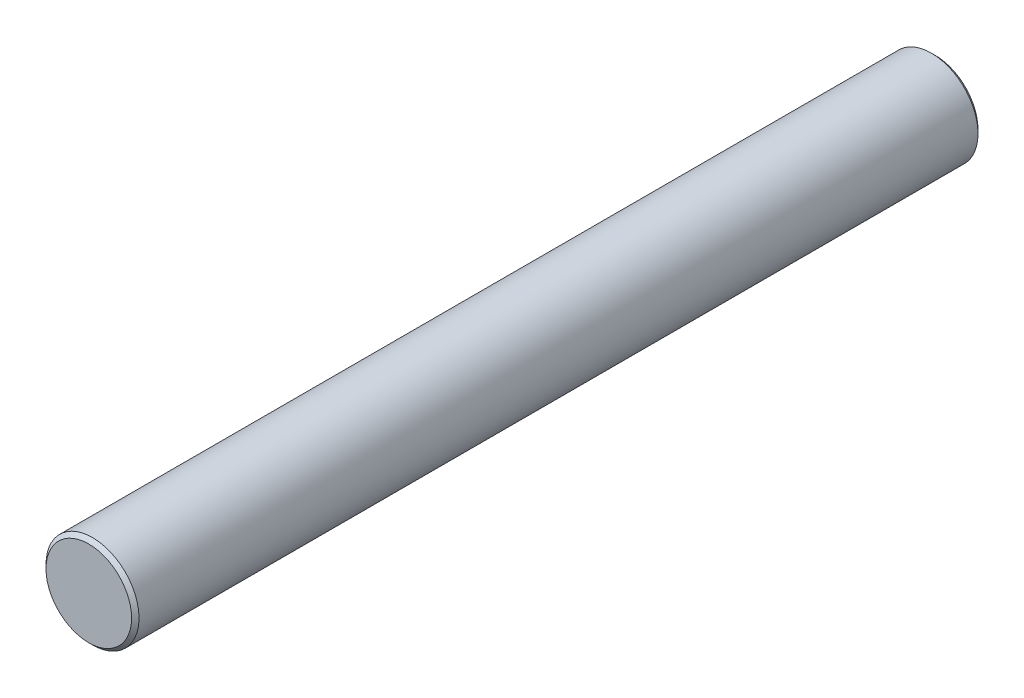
from build123d import *

# Parameters (mm, degrees)
SKETCH_1_R              = 25
EXTRUDE_1_DEPTH         = 455
HOLE_WIZARD_M16_1_D     = 14
HOLE_WIZARD_M16_1_DEPTH = 38
HOLE_WIZARD_M16_1_TIP   = 4.206024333
CHAMFER_1_SIZE          = 2


with BuildPart() as part:
    # Sketch 1 → Extrude 1 (new body)
    with BuildSketch(Plane.XY):
        with Locations(Location((0, 0, 0), (0, 0, 180))):
            Circle(SKETCH_1_R)
    extrude(amount=EXTRUDE_1_DEPTH)

    # Hole Wizard M16 _1
    with Locations(Plane(origin=(0, 0, 0), x_dir=(-1, 0, 0), z_dir=(0, 0, -1))):
        with Locations((0, 0)):
            Hole(HOLE_WIZARD_M16_1_D / 2, depth=HOLE_WIZARD_M16_1_DEPTH)
            with Locations((0, 0, -(HOLE_WIZARD_M16_1_DEPTH + HOLE_WIZARD_M16_1_TIP / 2))):  # 118° drill point
                Cone(0, HOLE_WIZARD_M16_1_D / 2, HOLE_WIZARD_M16_1_TIP, mode=Mode.SUBTRACT)

    # Chamfer 1
    chamfer_1_edges = [part.edges().sort_by_distance(p)[0] for p in [
        (25, 0, 0),
        (25, 0, 455),
    ]]
    chamfer(chamfer_1_edges, length=CHAMFER_1_SIZE)


solid = part.part
